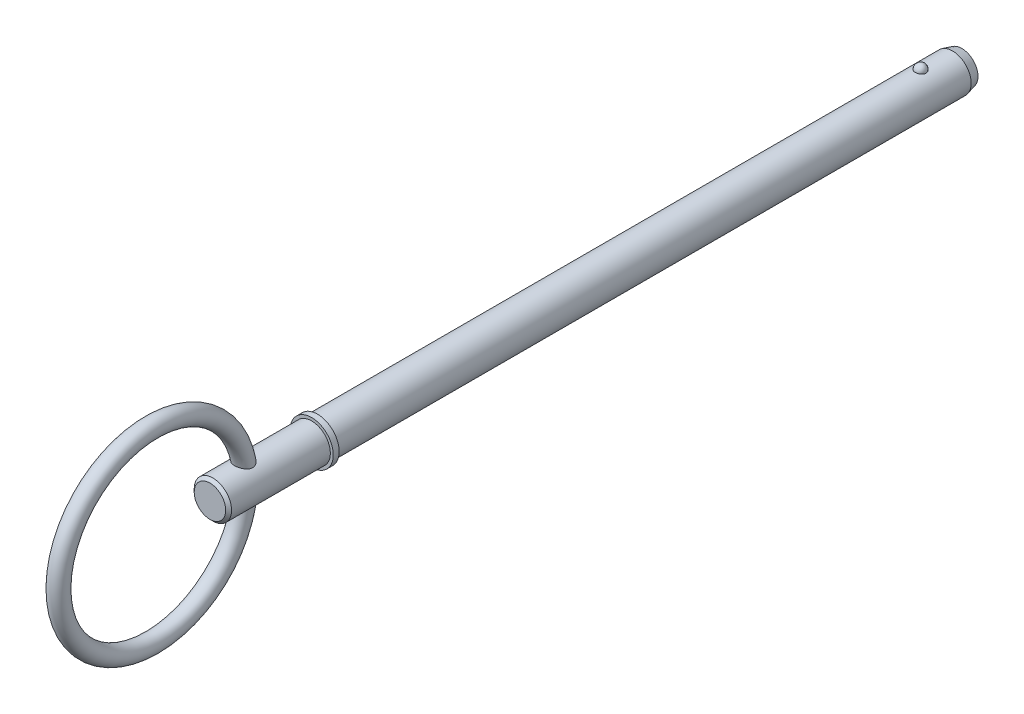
from build123d import *

# Parameters (mm, degrees)
SKETCH2_R           = 3.175
BOSS_EXTRUDE1_DEPTH = 101.6
BOSS_EXTRUDE2_START = 7.92
SKETCH3_R           = 3.175
BOSS_EXTRUDE2_DEPTH = 7.92
CHAMFER1_SIZE       = 1.586
CHAMFER1_SIZE2      = 0.424967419
SKETCH20_W          = 1
SKETCH20_H          = 3.675
SKETCH21_R          = 3.175
BOSS_EXTRUDE3_DEPTH = 18.29
CHAMFER2_SIZE       = 0.5
SKETCH24_R          = 1.5


with BuildPart() as part:
    # Sketch2 → Boss-Extrude1 (new body)
    with BuildSketch(Plane.XY):
        Circle(SKETCH2_R)
    extrude(amount=BOSS_EXTRUDE1_DEPTH)

    # Sketch3 → Boss-Extrude2 (add)
    with BuildSketch(Plane(origin=(0, 0, 0), x_dir=(-1, 0, 0), z_dir=(0, 0, -1)).offset(BOSS_EXTRUDE2_START)):
        Circle(SKETCH3_R)
    extrude(amount=-BOSS_EXTRUDE2_DEPTH)

    # Chamfer1
    chamfer1_edges = [part.edges().sort_by_distance(p)[0] for p in [
        (3.175, 0, -7.92),
    ]]
    chamfer1_side = [part.faces().sort_by_distance(p)[0] for p in [
        (3.175, 0, -3.96),
    ]]
    chamfer(chamfer1_edges, length=CHAMFER1_SIZE, length2=CHAMFER1_SIZE2, reference=chamfer1_side[0])

    # Sketch18 → Revolve1 (revolve)
    with BuildSketch(Plane(origin=(0, 0, 0), x_dir=(0, 0, -1), z_dir=(1, 0, 0))):
        with BuildLine():
            Line((0.91, 4.085), (0.91, 2.265))
            ThreePointArc((0.91, 2.265), (0, 3.175), (0.91, 4.085))
        make_face()
    revolve(axis=Axis((0, 4.085, -0.91), (0, -1, 0)))

    # Sketch20 → Revolve2 (revolve)
    with BuildSketch(Plane(origin=(0, 0, 0), x_dir=(0, 0, -1), z_dir=(1, 0, 0)), mode=Mode.PRIVATE) as revolve2_sk:
        with Locations((-102.1, 1.8375)):
            Rectangle(SKETCH20_W, SKETCH20_H)
    revolve(revolve2_sk.sketch.rotate(Axis((0, 0, 33.728787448), (0, 0, 1)), 90), axis=Axis((0, 0, 33.728787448), (0, 0, 1)))

    # Sketch21 → Boss-Extrude3 (add)
    with BuildSketch(Plane(origin=(0, 0, 101.6), x_dir=(-1, 0, 0), z_dir=(0, 0, -1))):
        Circle(SKETCH21_R)
    extrude(amount=-BOSS_EXTRUDE3_DEPTH)

    # Chamfer2
    chamfer2_edges = [part.edges().sort_by_distance(p)[0] for p in [
        (3.175, 0, 119.89),
    ]]
    chamfer(chamfer2_edges, length=CHAMFER2_SIZE)

    # Sweep1: sweep along a path in Sketch23
    with BuildLine(Plane(origin=(0, 0, 0), x_dir=(0, 0, -1), z_dir=(1, 0, 0))) as sweep1_path:
        CenterArc((-129.765, 0), 15.875, 0, 360)
    # Sketch24 → Sweep1 (sweep)
    with BuildSketch(Plane(origin=(0, 0, 0), x_dir=(1, 0, 0), z_dir=(0, 1, 0))):
        with Locations((0, -113.89)):
            Circle(SKETCH24_R)
    sweep(path=sweep1_path.line)


solid = part.part
